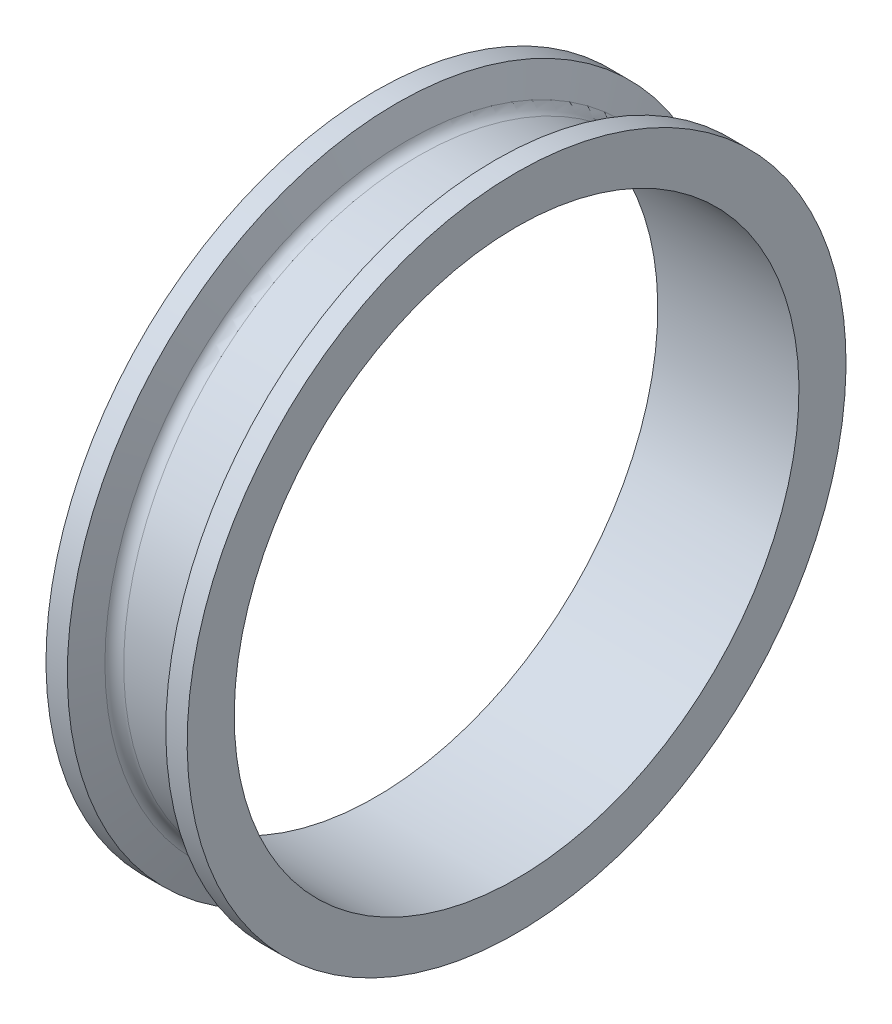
from build123d import *


with BuildPart() as part:
    # Sketch1 → Revolve1 (revolve)
    with BuildSketch(Plane.XY):
        with BuildLine():
            Line((-19.05, 88.9), (-13.2842, 88.9))
            Line((-13.2842, 88.9), (-10.577748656, 81.464086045))
            ThreePointArc((-10.577748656, 81.464086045), (-9.41532977, 79.949192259), (-7.594224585, 79.375))
            Line((-7.594224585, 79.375), (7.594224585, 79.375))
            ThreePointArc((7.594224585, 79.375), (9.41532977, 79.949192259), (10.577748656, 81.464086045))
            Line((10.577748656, 81.464086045), (13.2842, 88.9))
            Line((13.2842, 88.9), (19.05, 88.9))
            Line((19.05, 88.9), (19.05, 76.2))
            Line((19.05, 76.2), (-19.05, 76.2))
            Line((-19.05, 76.2), (-19.05, 88.9))
        make_face()
    revolve(axis=Axis((22.450298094, 0, 0), (-1, 0, 0)))


solid = part.part
